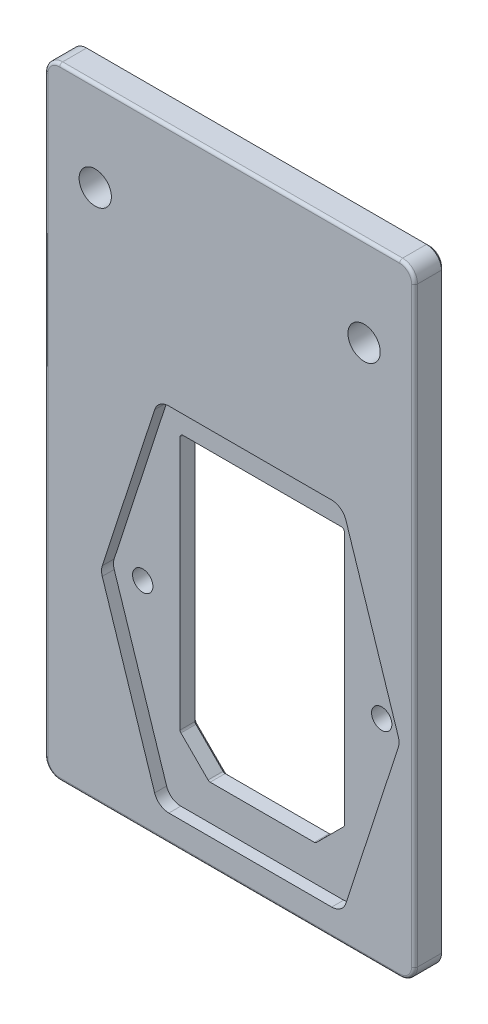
from build123d import *

# Parameters (mm, degrees)
SZKIC1_W                    = 61.897148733
SZKIC1_H                    = 104
SZKIC1_R                    = 2.7
SZKIC1_R_2                  = 1.7
DODANIE_WYCI_GNI_CIE1_DEPTH = 5
WYTNIJ_WYCI_GNI_CIE2_DEPTH  = 2
ZAOKR_GLENIE1_R             = 2.5
ZAOKR_GLENIE2_R             = 0.5
ZAOKR_GLENIE3_R             = 0.5
SFAZOWANIE1_SIZE            = 0.5


with BuildPart() as part:
    # Szkic1 → Dodanie-wyci_gni_cie1 (new body)
    with BuildSketch(Plane.XY):
        with Locations((-74.187495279, 50.711952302)):
            Rectangle(SZKIC1_W, SZKIC1_H)
        with Locations((-96.687495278, 87.711952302)):
            Circle(SZKIC1_R, mode=Mode.SUBTRACT)
        with Locations((-51.687495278, 87.711952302)):
            Circle(SZKIC1_R, mode=Mode.SUBTRACT)
        with Locations((-90.738910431, 32.711949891)):
            Circle(SZKIC1_R_2, mode=Mode.SUBTRACT)
        with Locations((-50.738920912, 32.711949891)):
            Circle(SZKIC1_R_2, mode=Mode.SUBTRACT)
        Polygon((-56.988915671, 57.143752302), (-84.488915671, 57.143752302), (-84.488915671, 13.97514213), (-79.657525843, 9.143752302), (-61.8203055, 9.143752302), (-56.988915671, 13.97514213), align=None, mode=Mode.SUBTRACT)
    extrude(amount=DODANIE_WYCI_GNI_CIE1_DEPTH)

    # Szkic2 → Wytnij-wyci_gni_cie2 (cut)
    with BuildSketch(Plane.XY.offset(5)):
        with BuildLine():
            Line((-95.513805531, 31.939701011), (-86.744629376, 4.939701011))
            ThreePointArc((-86.744629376, 4.939701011), (-85.836480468, 3.689499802), (-84.36689349, 3.211952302))
            Line((-84.36689349, 3.211952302), (-57.110937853, 3.211952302))
            ThreePointArc((-57.110937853, 3.211952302), (-55.641350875, 3.689499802), (-54.733201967, 4.939701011))
            Line((-54.733201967, 4.939701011), (-45.964025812, 31.939701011))
            ThreePointArc((-45.964025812, 31.939701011), (-45.841761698, 32.711952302), (-45.964025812, 33.484203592))
            Line((-45.964025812, 33.484203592), (-54.733201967, 60.484203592))
            ThreePointArc((-54.733201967, 60.484203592), (-55.641350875, 61.734404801), (-57.110937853, 62.211952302))
            Line((-57.110937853, 62.211952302), (-84.36689349, 62.211952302))
            ThreePointArc((-84.36689349, 62.211952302), (-85.836480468, 61.734404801), (-86.744629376, 60.484203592))
            Line((-86.744629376, 60.484203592), (-95.513805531, 33.484203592))
            ThreePointArc((-95.513805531, 33.484203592), (-95.636069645, 32.711952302), (-95.513805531, 31.939701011))
        make_face()
    extrude(amount=-WYTNIJ_WYCI_GNI_CIE2_DEPTH, mode=Mode.SUBTRACT)

    # Zaokr_glenie1
    zaokr_glenie1_edges = [part.edges().sort_by_distance(p)[0] for p in [
        (-105.136069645, 102.711952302, 2.5),
        (-43.238920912, 102.711952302, 2.5),
        (-43.238920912, -1.288047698, 2.5),
        (-105.136069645, -1.288047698, 2.5),
    ]]
    fillet(zaokr_glenie1_edges, radius=ZAOKR_GLENIE1_R)

    # Zaokr_glenie2
    zaokr_glenie2_edges = [part.edges().sort_by_distance(p)[0] for p in [
        (-61.8203055, 9.143752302, 1.5),
        (-56.988915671, 13.97514213, 1.5),
        (-79.657525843, 9.143752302, 1.5),
        (-84.488915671, 13.97514213, 1.5),
        (-84.488915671, 57.143752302, 1.5),
        (-56.988915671, 57.143752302, 1.5),
    ]]
    fillet(zaokr_glenie2_edges, radius=ZAOKR_GLENIE2_R)

    # Zaokr_glenie3
    zaokr_glenie3_edges = [part.edges().sort_by_distance(p)[0] for p in [
        (-43.238920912, 50.711952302, 5),
        (-105.136069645, 50.711952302, 5),
        (-74.187495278, -1.288047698, 5),
        (-43.971153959, -0.555814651, 5),
        (-104.403836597, -0.555814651, 5),
        (-104.403836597, 101.979719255, 5),
        (-43.971153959, 101.979719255, 5),
        (-74.187495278, 102.711952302, 5),
    ]]
    fillet(zaokr_glenie3_edges, radius=ZAOKR_GLENIE3_R)

    # Sfazowanie1
    sfazowanie1_edges = [part.edges().sort_by_distance(p)[0] for p in [
        (-105.136069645, 50.711952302, 0),
        (-43.238920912, 50.711952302, 0),
        (-74.187495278, -1.288047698, 0),
        (-43.971153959, -0.555814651, 0),
        (-104.403836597, -0.555814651, 0),
        (-104.403836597, 101.979719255, 0),
        (-43.971153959, 101.979719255, 0),
        (-59.404610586, 11.559447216, 0),
        (-56.988915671, 35.413000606, 0),
        (-70.738915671, 9.143752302, 0),
        (-82.073220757, 11.559447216, 0),
        (-84.488915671, 35.413000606, 0),
        (-70.738915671, 57.143752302, 0),
        (-57.026975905, 13.990907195, 0),
        (-61.836070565, 9.181812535, 0),
        (-79.641760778, 9.181812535, 0),
        (-84.450855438, 13.990907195, 0),
        (-84.342469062, 56.997305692, 0),
        (-57.135362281, 56.997305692, 0),
        (-99.387495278, 87.711952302, 0),
        (-54.387495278, 87.711952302, 0),
        (-92.438910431, 32.711949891, 0),
        (-52.438920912, 32.711949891, 0),
        (-74.187495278, 102.711952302, 0),
    ]]
    chamfer(sfazowanie1_edges, length=SFAZOWANIE1_SIZE)


solid = part.part
